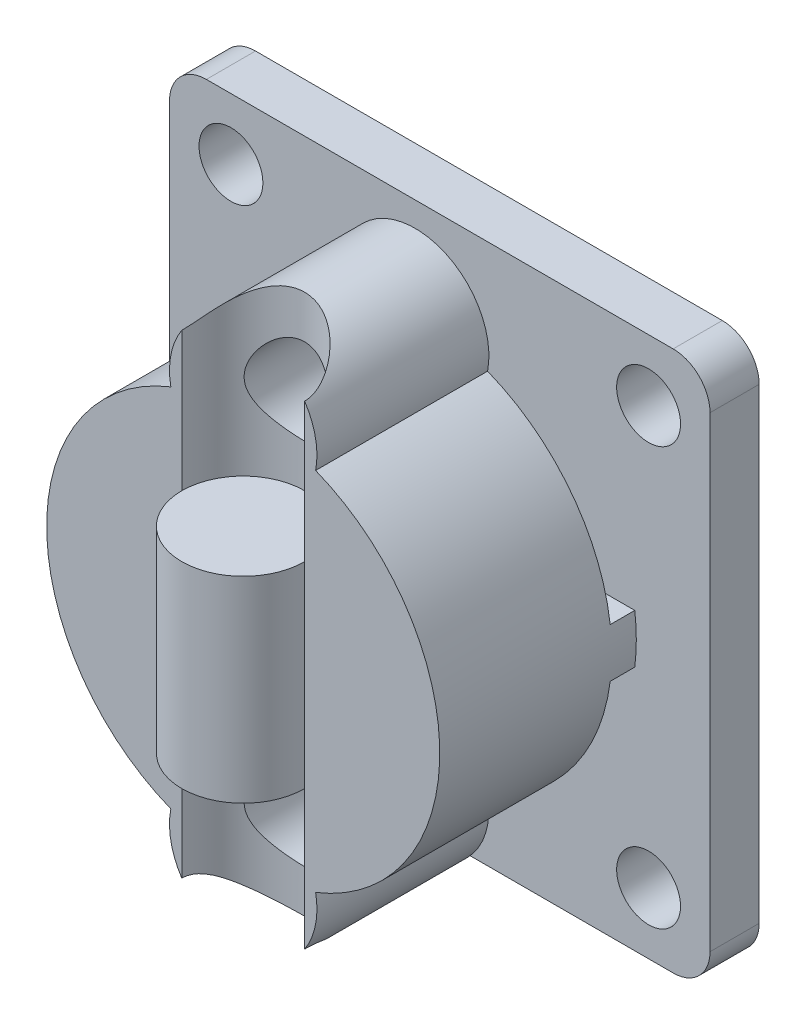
from build123d import *

# Parameters (mm, degrees)
ESQUISSE1_W                     = 22
ESQUISSE1_H                     = 22
EXTRUSION1_DEPTH                = 2
EXTRUSION2_DEPTH                = 8
ESQUISSE3_R                     = 2.5
ENL_V_MAT_EXTRU_1_DEPTH         = 33.680269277
D_GAGEMENT_M21_D                = 2.6
R_P_TITION_LIN_AIRE1_COUNT      = 2
R_P_TITION_LIN_AIRE1_PITCH      = 17
R_P_TITION_LIN_AIRE1_COUNT_DIR2 = 2
R_P_TITION_LIN_AIRE1_PITCH_DIR2 = 17
CONG_1_R                        = 1.5
ESQUISSE8_R                     = 9
ESQUISSE8_R_2                   = 6
EXTRUSION4_DEPTH                = 2
CONG_2_R                        = 0.2
ESQUISSE11_W                    = 1
ESQUISSE11_H                    = 10.989907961
ESQUISSE11_H_2                  = 13.046746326
ENL_V_MAT_EXTRU_3_DEPTH         = 33.680269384
ESQUISSE7_R                     = 1.75
ENL_V_MAT_EXTRU_2_DEPTH         = 5
TROU_TARAUD_M2X0_41_D           = 1.6
ENL_V_MAT_EXTRU_5_REACH         = 33.89
ESQUISSE13_R                    = 0.9
R_P_TITION_LIN_AIRE2_COUNT      = 2
R_P_TITION_LIN_AIRE2_PITCH      = 15
ESQUISSE12_R                    = 2
ENL_V_MAT_EXTRU_4_DEPTH         = 33.680269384
ESQUISSE4_R                     = 2.5
EXTRUSION3_DEPTH                = 4


with BuildPart() as part:
    # Esquisse1 → Extrusion1 (new body)
    with BuildSketch(Plane.XY):
        with Locations((-11, 11)):
            Rectangle(ESQUISSE1_W, ESQUISSE1_H)
    extrude(amount=EXTRUSION1_DEPTH)

    # Esquisse2 → Extrusion2 (add)
    with BuildSketch(Plane.XY.offset(2)):
        with BuildLine():
            ThreePointArc((-13.946793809, 18.4375), (-19, 11), (-13.946793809, 3.5625))
            ThreePointArc((-13.946793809, 3.5625), (-11, 0), (-8.053206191, 3.5625))
            ThreePointArc((-8.053206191, 3.5625), (-3, 11), (-8.053206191, 18.4375))
            ThreePointArc((-8.053206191, 18.4375), (-11, 22), (-13.946793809, 18.4375))
        make_face()
    extrude(amount=EXTRUSION2_DEPTH)

    # Esquisse3 → Enl_v. mat.-Extru.1 (cut, through all)
    with BuildSketch(Plane(origin=(0, 22, 0), x_dir=(-1, 0, 0), z_dir=(0, 1, 0))):
        with Locations((11, 10)):
            Circle(ESQUISSE3_R)
    extrude(amount=-ENL_V_MAT_EXTRU_1_DEPTH, mode=Mode.SUBTRACT)

    # D_gagement M21 (through all)
    with Locations(Plane.XY.offset(2)):
        with Locations((-2.5, 19.5)):
            d_gagement_m21 = Hole(D_GAGEMENT_M21_D / 2)

    # R_p_tition lin_aire1: D_gagement M21 2 × 2
    with Locations(*[(-j * R_P_TITION_LIN_AIRE1_PITCH_DIR2, -i * R_P_TITION_LIN_AIRE1_PITCH, 0) for i in range(R_P_TITION_LIN_AIRE1_COUNT) for j in range(R_P_TITION_LIN_AIRE1_COUNT_DIR2) if (i, j) != (0, 0)]):
        add(d_gagement_m21, mode=Mode.SUBTRACT)

    # Cong_1
    cong_1_edges = [part.edges().sort_by_distance(p)[0] for p in [
        (-22, 22, 1),
        (0, 22, 1),
        (0, 0, 1),
        (-22, 0, 1),
    ]]
    fillet(cong_1_edges, radius=CONG_1_R)

    # Esquisse8 → Extrusion4 (add)
    with BuildSketch(Plane(origin=(0, 0, 0), x_dir=(-1, 0, 0), z_dir=(0, 0, -1))):
        with Locations(Location((11, 11, 0), (0, 0, 180))):
            Circle(ESQUISSE8_R)
        with Locations((11, 11)):
            Circle(ESQUISSE8_R_2, mode=Mode.SUBTRACT)
    extrude(amount=EXTRUSION4_DEPTH)

    # Cong_2
    cong_2_edges = [part.edges().sort_by_distance(p)[0] for p in [
        (-20, 11, -2),
        (-5, 11, -2),
    ]]
    fillet(cong_2_edges, radius=CONG_2_R)

    # Esquisse11 → Enl_v. mat.-Extru.3 (cut, through all)
    with BuildSketch(Plane.ZY.offset(22)):
        with Locations((2.5, 17.494953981)):
            Rectangle(ESQUISSE11_W, ESQUISSE11_H)
        with Locations((2.5, 3.476626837)):
            Rectangle(ESQUISSE11_W, ESQUISSE11_H_2)
    extrude(amount=-ENL_V_MAT_EXTRU_3_DEPTH, mode=Mode.SUBTRACT)

    # Esquisse7 → Enl_v. mat.-Extru.2 (cut)
    with BuildSketch(Plane.XY.offset(10)):
        with Locations((-11, 18.5)):
            Circle(ESQUISSE7_R)
    enl_v_mat_extru_2 = extrude(amount=-ENL_V_MAT_EXTRU_2_DEPTH, mode=Mode.SUBTRACT)

    # Trou taraud_ M2x0.41 (through all)
    with Locations(Plane.XY.offset(5)):
        with Locations((-11, 18.5)):
            trou_taraud_m2x0_41 = Hole(TROU_TARAUD_M2X0_41_D / 2)

    # Esquisse13 → Enl_v. mat.-Extru.5 (cut, up to next)
    with BuildSketch(Plane.XY.offset(5), mode=Mode.PRIVATE) as enl_v_mat_extru_5_sk1:
        with Locations((-11, 18.5)):
            Circle(ESQUISSE13_R)
    enl_v_mat_extru_5_tool1 = extrude(enl_v_mat_extru_5_sk1.sketch, amount=-ENL_V_MAT_EXTRU_5_REACH, mode=Mode.PRIVATE) & part.part
    enl_v_mat_extru_5 = enl_v_mat_extru_5_tool1.solids().sort_by_distance((-11, 18.5, 5))[0]
    add(enl_v_mat_extru_5, mode=Mode.SUBTRACT)

    # R_p_tition lin_aire2: Enl_v. mat.-Extru.2, Trou taraud_ M2x0.41, Enl_v. mat.-Extru.5 ×2
    with Locations(*[(0, -i * R_P_TITION_LIN_AIRE2_PITCH, 0) for i in range(1, R_P_TITION_LIN_AIRE2_COUNT)]):
        add(enl_v_mat_extru_2, mode=Mode.SUBTRACT)
        add(trou_taraud_m2x0_41, mode=Mode.SUBTRACT)
        add(enl_v_mat_extru_5, mode=Mode.SUBTRACT)

    # Esquisse12 → Enl_v. mat.-Extru.4 (cut, through all)
    with BuildSketch(Plane(origin=(0, 0, 0), x_dir=(-1, 0, 0), z_dir=(0, 0, -1))):
        with Locations((11, 11)):
            Circle(ESQUISSE12_R)
    extrude(amount=-ENL_V_MAT_EXTRU_4_DEPTH, mode=Mode.SUBTRACT)

    # Esquisse4 → Extrusion3 (add, symmetric)
    with BuildSketch(Plane(origin=(0, 11, 0), x_dir=(-1, 0, 0), z_dir=(0, 1, 0))):
        with Locations((11, 10)):
            Circle(ESQUISSE4_R)
    extrude(amount=EXTRUSION3_DEPTH, both=True)


solid = part.part
